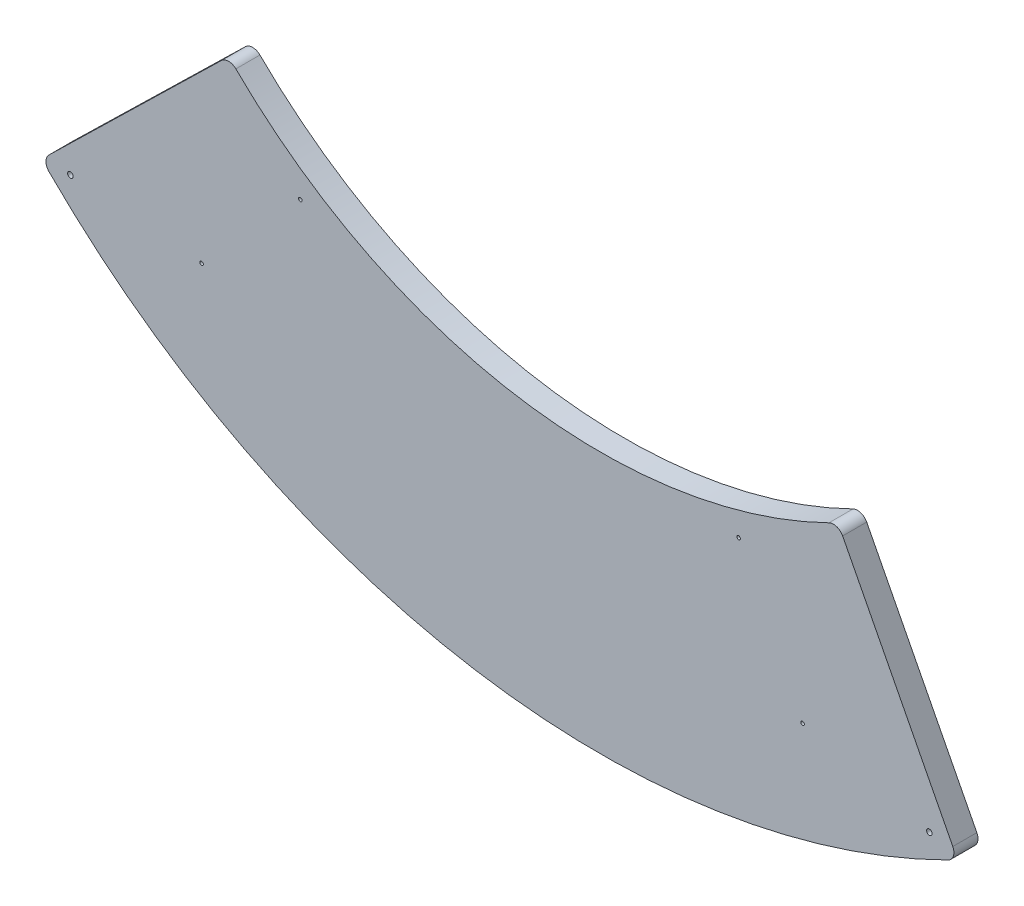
ISO-10303-21;
HEADER;
FILE_DESCRIPTION(('STEP AP214'),'2;1');
FILE_NAME('part.step','',(''),(''),'','','');
FILE_SCHEMA(('AUTOMOTIVE_DESIGN { 1 0 10303 214 1 1 1 1 }'));
ENDSEC;
DATA;
#1=APPLICATION_CONTEXT('core data for automotive mechanical design processes');
#2=APPLICATION_PROTOCOL_DEFINITION('international standard','automotive_design',2000,#1);
#3=PRODUCT_CONTEXT('',#1,'mechanical');
#4=PRODUCT('Part','Part','',(#3));
#5=PRODUCT_RELATED_PRODUCT_CATEGORY('part','',(#4));
#6=PRODUCT_DEFINITION_FORMATION('','',#4);
#7=PRODUCT_DEFINITION_CONTEXT('part definition',#1,'design');
#8=PRODUCT_DEFINITION('design','',#6,#7);
#9=PRODUCT_DEFINITION_SHAPE('','',#8);
#10=(LENGTH_UNIT() NAMED_UNIT(*) SI_UNIT(.MILLI.,.METRE.));
#11=(NAMED_UNIT(*) PLANE_ANGLE_UNIT() SI_UNIT($,.RADIAN.));
#12=(NAMED_UNIT(*) SI_UNIT($,.STERADIAN.) SOLID_ANGLE_UNIT());
#13=UNCERTAINTY_MEASURE_WITH_UNIT(LENGTH_MEASURE(1.E-05),#10,'distance_accuracy_value','');
#14=(GEOMETRIC_REPRESENTATION_CONTEXT(3) GLOBAL_UNCERTAINTY_ASSIGNED_CONTEXT((#13)) GLOBAL_UNIT_ASSIGNED_CONTEXT((#10,
#11,#12)) REPRESENTATION_CONTEXT('',''));
#15=CARTESIAN_POINT('',(0.,0.,0.));
#16=DIRECTION('',(0.,0.,1.));
#17=DIRECTION('',(1.,0.,0.));
#18=AXIS2_PLACEMENT_3D('',#15,#16,#17);
#19=CARTESIAN_POINT('',(-1.33217780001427,26.0153346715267,35.));
#20=DIRECTION('',(0.,0.,-1.));
#21=DIRECTION('',(-1.,0.,0.));
#22=AXIS2_PLACEMENT_3D('',#19,#20,#21);
#23=CYLINDRICAL_SURFACE('',#22,755.);
#24=CARTESIAN_POINT('',(-1.33217780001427,26.0153346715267,0.));
#25=DIRECTION('',(0.,0.,-1.));
#26=DIRECTION('',(1.,0.,0.));
#27=AXIS2_PLACEMENT_3D('',#24,#25,#26);
#28=CIRCLE('',#27,755.);
#29=CARTESIAN_POINT('',(331.253561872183,-651.783843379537,0.));
#30=VERTEX_POINT('',#29);
#31=CARTESIAN_POINT('',(-531.749186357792,-511.276761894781,0.));
#32=VERTEX_POINT('',#31);
#33=EDGE_CURVE('E129',#30,#32,#28,.T.);
#34=ORIENTED_EDGE('',*,*,#33,.T.);
#35=DIRECTION('',(0.,0.,-1.));
#36=VECTOR('',#35,1.);
#37=CARTESIAN_POINT('',(-531.749186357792,-511.276761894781,35.));
#38=LINE('',#37,#36);
#39=CARTESIAN_POINT('',(-531.749186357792,-511.276761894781,35.));
#40=VERTEX_POINT('',#39);
#41=EDGE_CURVE('E151',#32,#40,#38,.F.);
#42=ORIENTED_EDGE('',*,*,#41,.T.);
#43=CARTESIAN_POINT('',(-1.33217780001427,26.0153346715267,35.));
#44=DIRECTION('',(0.,0.,-1.));
#45=DIRECTION('',(1.,0.,0.));
#46=AXIS2_PLACEMENT_3D('',#43,#44,#45);
#47=CIRCLE('',#46,755.);
#48=CARTESIAN_POINT('',(331.253561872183,-651.783843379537,35.));
#49=VERTEX_POINT('',#48);
#50=EDGE_CURVE('E127',#49,#40,#47,.T.);
#51=ORIENTED_EDGE('',*,*,#50,.F.);
#52=DIRECTION('',(0.,0.,-1.));
#53=VECTOR('',#52,1.);
#54=CARTESIAN_POINT('',(331.253561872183,-651.783843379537,35.));
#55=LINE('',#54,#53);
#56=EDGE_CURVE('E148',#49,#30,#55,.T.);
#57=ORIENTED_EDGE('',*,*,#56,.T.);
#58=EDGE_LOOP('',(#34,#42,#51,#57));
#59=FACE_BOUND('',#58,.T.);
#60=ADVANCED_FACE('F32',(#59),#23,.F.);
#61=CARTESIAN_POINT('',(-542.115261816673,-500.842004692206,35.));
#62=DIRECTION('',(0.697824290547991,-0.716268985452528,0.));
#63=DIRECTION('',(0.716268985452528,0.697824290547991,0.));
#64=AXIS2_PLACEMENT_3D('',#61,#62,#63);
#65=PLANE('',#64);
#66=DIRECTION('',(-0.716268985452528,-0.697824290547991,0.));
#67=VECTOR('',#66,1.);
#68=CARTESIAN_POINT('',(-542.115261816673,-500.842004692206,0.));
#69=LINE('',#68,#67);
#70=CARTESIAN_POINT('',(-552.754636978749,-511.207404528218,0.));
#71=VERTEX_POINT('',#70);
#72=CARTESIAN_POINT('',(-803.49069567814,-755.48674068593,0.));
#73=VERTEX_POINT('',#72);
#74=EDGE_CURVE('E125',#71,#73,#69,.T.);
#75=ORIENTED_EDGE('',*,*,#74,.T.);
#76=DIRECTION('',(0.,0.,-1.));
#77=VECTOR('',#76,1.);
#78=CARTESIAN_POINT('',(-803.49069567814,-755.48674068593,35.));
#79=LINE('',#78,#77);
#80=CARTESIAN_POINT('',(-803.49069567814,-755.48674068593,35.));
#81=VERTEX_POINT('',#80);
#82=EDGE_CURVE('E103',#73,#81,#79,.F.);
#83=ORIENTED_EDGE('',*,*,#82,.T.);
#84=DIRECTION('',(-0.716268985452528,-0.697824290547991,0.));
#85=VECTOR('',#84,1.);
#86=CARTESIAN_POINT('',(-542.115261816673,-500.842004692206,35.));
#87=LINE('',#86,#85);
#88=CARTESIAN_POINT('',(-552.754636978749,-511.207404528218,35.));
#89=VERTEX_POINT('',#88);
#90=EDGE_CURVE('E165',#89,#81,#87,.T.);
#91=ORIENTED_EDGE('',*,*,#90,.F.);
#92=DIRECTION('',(0.,0.,-1.));
#93=VECTOR('',#92,1.);
#94=CARTESIAN_POINT('',(-552.754636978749,-511.207404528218,35.));
#95=LINE('',#94,#93);
#96=EDGE_CURVE('E108',#89,#71,#95,.T.);
#97=ORIENTED_EDGE('',*,*,#96,.T.);
#98=EDGE_LOOP('',(#75,#83,#91,#97));
#99=FACE_BOUND('',#98,.T.);
#100=ADVANCED_FACE('F170',(#99),#65,.F.);
#101=CARTESIAN_POINT('',(-1.59353768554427,24.4100469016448,35.));
#102=DIRECTION('',(0.,0.,-1.));
#103=DIRECTION('',(-1.,0.,0.));
#104=AXIS2_PLACEMENT_3D('',#101,#102,#103);
#105=CYLINDRICAL_SURFACE('',#104,1133.69300000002);
#106=CARTESIAN_POINT('',(-1.59353768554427,24.4100469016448,35.));
#107=DIRECTION('',(0.,0.,1.));
#108=DIRECTION('',(-1.,0.,0.));
#109=AXIS2_PLACEMENT_3D('',#106,#107,#108);
#110=CIRCLE('',#109,1133.69300000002);
#111=CARTESIAN_POINT('',(-803.635221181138,-776.832086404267,35.));
#112=VERTEX_POINT('',#111);
#113=CARTESIAN_POINT('',(504.859516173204,-989.870546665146,35.));
#114=VERTEX_POINT('',#113);
#115=EDGE_CURVE('E117',#112,#114,#110,.T.);
#116=ORIENTED_EDGE('',*,*,#115,.F.);
#117=DIRECTION('',(0.,0.,-1.));
#118=VECTOR('',#117,1.);
#119=CARTESIAN_POINT('',(-803.635221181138,-776.832086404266,35.));
#120=LINE('',#119,#118);
#121=CARTESIAN_POINT('',(-803.635221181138,-776.832086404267,0.));
#122=VERTEX_POINT('',#121);
#123=EDGE_CURVE('E102',#112,#122,#120,.T.);
#124=ORIENTED_EDGE('',*,*,#123,.T.);
#125=CARTESIAN_POINT('',(-1.59353768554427,24.4100469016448,0.));
#126=DIRECTION('',(0.,0.,1.));
#127=DIRECTION('',(-1.,0.,0.));
#128=AXIS2_PLACEMENT_3D('',#125,#126,#127);
#129=CIRCLE('',#128,1133.69300000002);
#130=CARTESIAN_POINT('',(504.859516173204,-989.870546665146,0.));
#131=VERTEX_POINT('',#130);
#132=EDGE_CURVE('E115',#122,#131,#129,.T.);
#133=ORIENTED_EDGE('',*,*,#132,.T.);
#134=DIRECTION('',(0.,0.,-1.));
#135=VECTOR('',#134,1.);
#136=CARTESIAN_POINT('',(504.859516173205,-989.870546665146,35.));
#137=LINE('',#136,#135);
#138=EDGE_CURVE('E119',#131,#114,#137,.F.);
#139=ORIENTED_EDGE('',*,*,#138,.T.);
#140=EDGE_LOOP('',(#116,#124,#133,#139));
#141=FACE_BOUND('',#140,.T.);
#142=ADVANCED_FACE('F114',(#141),#105,.T.);
#143=CARTESIAN_POINT('',(344.394329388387,-645.176278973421,35.));
#144=DIRECTION('',(-0.88899551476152,-0.457915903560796,0.));
#145=DIRECTION('',(0.457915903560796,-0.88899551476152,0.));
#146=AXIS2_PLACEMENT_3D('',#143,#144,#145);
#147=PLANE('',#146);
#148=DIRECTION('',(-0.457915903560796,0.88899551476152,0.));
#149=VECTOR('',#148,1.);
#150=CARTESIAN_POINT('',(344.394329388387,-645.176278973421,35.));
#151=LINE('',#150,#149);
#152=CARTESIAN_POINT('',(511.493520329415,-969.581765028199,35.));
#153=VERTEX_POINT('',#152);
#154=CARTESIAN_POINT('',(351.196158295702,-658.381313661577,35.));
#155=VERTEX_POINT('',#154);
#156=EDGE_CURVE('E133',#153,#155,#151,.T.);
#157=ORIENTED_EDGE('',*,*,#156,.F.);
#158=DIRECTION('',(0.,0.,-1.));
#159=VECTOR('',#158,1.);
#160=CARTESIAN_POINT('',(511.493520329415,-969.581765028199,35.));
#161=LINE('',#160,#159);
#162=CARTESIAN_POINT('',(511.493520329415,-969.581765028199,0.));
#163=VERTEX_POINT('',#162);
#164=EDGE_CURVE('E11',#153,#163,#161,.T.);
#165=ORIENTED_EDGE('',*,*,#164,.T.);
#166=DIRECTION('',(-0.457915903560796,0.88899551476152,0.));
#167=VECTOR('',#166,1.);
#168=CARTESIAN_POINT('',(344.394329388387,-645.176278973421,0.));
#169=LINE('',#168,#167);
#170=CARTESIAN_POINT('',(351.196158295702,-658.381313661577,0.));
#171=VERTEX_POINT('',#170);
#172=EDGE_CURVE('E124',#163,#171,#169,.T.);
#173=ORIENTED_EDGE('',*,*,#172,.T.);
#174=DIRECTION('',(0.,0.,-1.));
#175=VECTOR('',#174,1.);
#176=CARTESIAN_POINT('',(351.196158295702,-658.381313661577,35.));
#177=LINE('',#176,#175);
#178=EDGE_CURVE('E40',#171,#155,#177,.F.);
#179=ORIENTED_EDGE('',*,*,#178,.T.);
#180=EDGE_LOOP('',(#157,#165,#173,#179));
#181=FACE_BOUND('',#180,.T.);
#182=ADVANCED_FACE('F223',(#181),#147,.F.);
#183=CARTESIAN_POINT('',(-1.33217780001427,26.0153346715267,35.));
#184=DIRECTION('',(0.,0.,1.));
#185=DIRECTION('',(1.,0.,0.));
#186=AXIS2_PLACEMENT_3D('',#183,#184,#185);
#187=PLANE('',#186);
#188=CARTESIAN_POINT('',(477.402158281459,-968.553817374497,35.));
#189=DIRECTION('',(0.,0.,1.));
#190=DIRECTION('',(1.,0.,0.));
#191=AXIS2_PLACEMENT_3D('',#188,#189,#190);
#192=CIRCLE('',#191,3.99999999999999);
#193=CARTESIAN_POINT('',(481.402158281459,-968.553817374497,35.));
#194=VERTEX_POINT('',#193);
#195=EDGE_CURVE('E206',#194,#194,#192,.T.);
#196=ORIENTED_EDGE('',*,*,#195,.F.);
#197=EDGE_LOOP('',(#196));
#198=FACE_BOUND('',#197,.T.);
#199=CARTESIAN_POINT('',(-772.564911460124,-765.262621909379,35.));
#200=DIRECTION('',(0.,0.,1.));
#201=DIRECTION('',(1.,0.,0.));
#202=AXIS2_PLACEMENT_3D('',#199,#200,#201);
#203=CIRCLE('',#202,3.99999999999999);
#204=CARTESIAN_POINT('',(-768.564911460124,-765.262621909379,35.));
#205=VERTEX_POINT('',#204);
#206=EDGE_CURVE('E200',#205,#205,#203,.T.);
#207=ORIENTED_EDGE('',*,*,#206,.F.);
#208=EDGE_LOOP('',(#207));
#209=FACE_BOUND('',#208,.T.);
#210=CARTESIAN_POINT('',(-581.594325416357,-781.229882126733,35.));
#211=DIRECTION('',(0.,0.,-1.));
#212=DIRECTION('',(-1.,0.,0.));
#213=AXIS2_PLACEMENT_3D('',#210,#211,#212);
#214=CIRCLE('',#213,2.59999999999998);
#215=CARTESIAN_POINT('',(-584.194325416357,-781.229882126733,35.));
#216=VERTEX_POINT('',#215);
#217=EDGE_CURVE('E191',#216,#216,#214,.T.);
#218=ORIENTED_EDGE('',*,*,#217,.T.);
#219=EDGE_LOOP('',(#218));
#220=FACE_BOUND('',#219,.T.);
#221=CARTESIAN_POINT('',(-437.928955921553,-629.097500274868,35.));
#222=DIRECTION('',(0.,0.,-1.));
#223=DIRECTION('',(-1.,0.,0.));
#224=AXIS2_PLACEMENT_3D('',#221,#222,#223);
#225=CIRCLE('',#224,2.60000000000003);
#226=CARTESIAN_POINT('',(-440.528955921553,-629.097500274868,35.));
#227=VERTEX_POINT('',#226);
#228=EDGE_CURVE('E185',#227,#227,#225,.T.);
#229=ORIENTED_EDGE('',*,*,#228,.T.);
#230=EDGE_LOOP('',(#229));
#231=FACE_BOUND('',#230,.T.);
#232=CARTESIAN_POINT('',(292.8911808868,-923.60649279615,35.));
#233=DIRECTION('',(0.,0.,-1.));
#234=DIRECTION('',(-1.,0.,0.));
#235=AXIS2_PLACEMENT_3D('',#232,#233,#234);
#236=CIRCLE('',#235,2.60000000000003);
#237=CARTESIAN_POINT('',(290.2911808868,-923.60649279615,35.));
#238=VERTEX_POINT('',#237);
#239=EDGE_CURVE('E180',#238,#238,#236,.T.);
#240=ORIENTED_EDGE('',*,*,#239,.T.);
#241=EDGE_LOOP('',(#240));
#242=FACE_BOUND('',#241,.T.);
#243=CARTESIAN_POINT('',(199.79500937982,-736.210914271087,35.));
#244=DIRECTION('',(0.,0.,-1.));
#245=DIRECTION('',(-1.,0.,0.));
#246=AXIS2_PLACEMENT_3D('',#243,#244,#245);
#247=CIRCLE('',#246,2.60000000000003);
#248=CARTESIAN_POINT('',(197.19500937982,-736.210914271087,35.));
#249=VERTEX_POINT('',#248);
#250=EDGE_CURVE('E171',#249,#249,#247,.T.);
#251=ORIENTED_EDGE('',*,*,#250,.T.);
#252=EDGE_LOOP('',(#251));
#253=FACE_BOUND('',#252,.T.);
#254=ORIENTED_EDGE('',*,*,#90,.T.);
#255=CARTESIAN_POINT('',(-793.02333131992,-766.230775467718,35.));
#256=DIRECTION('',(0.,0.,1.));
#257=DIRECTION('',(1.,0.,0.));
#258=AXIS2_PLACEMENT_3D('',#255,#256,#257);
#259=CIRCLE('',#258,15.);
#260=EDGE_CURVE('E146',#81,#112,#259,.T.);
#261=ORIENTED_EDGE('',*,*,#260,.T.);
#262=ORIENTED_EDGE('',*,*,#115,.T.);
#263=CARTESIAN_POINT('',(498.158587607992,-976.450503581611,35.));
#264=DIRECTION('',(0.,0.,1.));
#265=DIRECTION('',(1.,0.,0.));
#266=AXIS2_PLACEMENT_3D('',#263,#264,#265);
#267=CIRCLE('',#266,15.);
#268=EDGE_CURVE('E53',#114,#153,#267,.T.);
#269=ORIENTED_EDGE('',*,*,#268,.T.);
#270=ORIENTED_EDGE('',*,*,#156,.T.);
#271=CARTESIAN_POINT('',(337.86122557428,-665.250052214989,35.));
#272=DIRECTION('',(0.,0.,1.));
#273=DIRECTION('',(1.,0.,0.));
#274=AXIS2_PLACEMENT_3D('',#271,#272,#273);
#275=CIRCLE('',#274,15.);
#276=EDGE_CURVE('E141',#155,#49,#275,.T.);
#277=ORIENTED_EDGE('',*,*,#276,.T.);
#278=ORIENTED_EDGE('',*,*,#50,.T.);
#279=CARTESIAN_POINT('',(-542.287272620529,-521.951439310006,35.));
#280=DIRECTION('',(0.,0.,1.));
#281=DIRECTION('',(1.,0.,0.));
#282=AXIS2_PLACEMENT_3D('',#279,#280,#281);
#283=CIRCLE('',#282,15.);
#284=EDGE_CURVE('E144',#40,#89,#283,.T.);
#285=ORIENTED_EDGE('',*,*,#284,.T.);
#286=EDGE_LOOP('',(#254,#261,#262,#269,#270,#277,#278,#285));
#287=FACE_BOUND('',#286,.T.);
#288=ADVANCED_FACE('F162',(#198,#209,#220,#231,#242,#253,#287),#187,.T.);
#289=CARTESIAN_POINT('',(-1.33217780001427,26.0153346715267,0.));
#290=DIRECTION('',(0.,0.,1.));
#291=DIRECTION('',(1.,0.,0.));
#292=AXIS2_PLACEMENT_3D('',#289,#290,#291);
#293=PLANE('',#292);
#294=CARTESIAN_POINT('',(477.402158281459,-968.553817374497,0.));
#295=DIRECTION('',(0.,0.,1.));
#296=DIRECTION('',(1.,0.,0.));
#297=AXIS2_PLACEMENT_3D('',#294,#295,#296);
#298=CIRCLE('',#297,3.99999999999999);
#299=CARTESIAN_POINT('',(481.402158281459,-968.553817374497,0.));
#300=VERTEX_POINT('',#299);
#301=EDGE_CURVE('E203',#300,#300,#298,.T.);
#302=ORIENTED_EDGE('',*,*,#301,.T.);
#303=EDGE_LOOP('',(#302));
#304=FACE_BOUND('',#303,.T.);
#305=CARTESIAN_POINT('',(-772.564911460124,-765.262621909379,0.));
#306=DIRECTION('',(0.,0.,1.));
#307=DIRECTION('',(1.,0.,0.));
#308=AXIS2_PLACEMENT_3D('',#305,#306,#307);
#309=CIRCLE('',#308,3.99999999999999);
#310=CARTESIAN_POINT('',(-768.564911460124,-765.262621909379,0.));
#311=VERTEX_POINT('',#310);
#312=EDGE_CURVE('E197',#311,#311,#309,.T.);
#313=ORIENTED_EDGE('',*,*,#312,.T.);
#314=EDGE_LOOP('',(#313));
#315=FACE_BOUND('',#314,.T.);
#316=CARTESIAN_POINT('',(-581.594325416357,-781.229882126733,0.));
#317=DIRECTION('',(0.,0.,-1.));
#318=DIRECTION('',(-1.,0.,0.));
#319=AXIS2_PLACEMENT_3D('',#316,#317,#318);
#320=CIRCLE('',#319,2.59999999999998);
#321=CARTESIAN_POINT('',(-584.194325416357,-781.229882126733,0.));
#322=VERTEX_POINT('',#321);
#323=EDGE_CURVE('E194',#322,#322,#320,.T.);
#324=ORIENTED_EDGE('',*,*,#323,.F.);
#325=EDGE_LOOP('',(#324));
#326=FACE_BOUND('',#325,.T.);
#327=CARTESIAN_POINT('',(-437.928955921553,-629.097500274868,0.));
#328=DIRECTION('',(0.,0.,-1.));
#329=DIRECTION('',(-1.,0.,0.));
#330=AXIS2_PLACEMENT_3D('',#327,#328,#329);
#331=CIRCLE('',#330,2.60000000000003);
#332=CARTESIAN_POINT('',(-440.528955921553,-629.097500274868,0.));
#333=VERTEX_POINT('',#332);
#334=EDGE_CURVE('E188',#333,#333,#331,.T.);
#335=ORIENTED_EDGE('',*,*,#334,.F.);
#336=EDGE_LOOP('',(#335));
#337=FACE_BOUND('',#336,.T.);
#338=CARTESIAN_POINT('',(292.8911808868,-923.60649279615,0.));
#339=DIRECTION('',(0.,0.,-1.));
#340=DIRECTION('',(-1.,0.,0.));
#341=AXIS2_PLACEMENT_3D('',#338,#339,#340);
#342=CIRCLE('',#341,2.60000000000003);
#343=CARTESIAN_POINT('',(290.2911808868,-923.60649279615,0.));
#344=VERTEX_POINT('',#343);
#345=EDGE_CURVE('E182',#344,#344,#342,.T.);
#346=ORIENTED_EDGE('',*,*,#345,.F.);
#347=EDGE_LOOP('',(#346));
#348=FACE_BOUND('',#347,.T.);
#349=CARTESIAN_POINT('',(199.79500937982,-736.210914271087,0.));
#350=DIRECTION('',(0.,0.,-1.));
#351=DIRECTION('',(-1.,0.,0.));
#352=AXIS2_PLACEMENT_3D('',#349,#350,#351);
#353=CIRCLE('',#352,2.60000000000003);
#354=CARTESIAN_POINT('',(197.19500937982,-736.210914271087,0.));
#355=VERTEX_POINT('',#354);
#356=EDGE_CURVE('E173',#355,#355,#353,.T.);
#357=ORIENTED_EDGE('',*,*,#356,.F.);
#358=EDGE_LOOP('',(#357));
#359=FACE_BOUND('',#358,.T.);
#360=ORIENTED_EDGE('',*,*,#132,.F.);
#361=CARTESIAN_POINT('',(-793.02333131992,-766.230775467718,0.));
#362=DIRECTION('',(0.,0.,1.));
#363=DIRECTION('',(1.,0.,0.));
#364=AXIS2_PLACEMENT_3D('',#361,#362,#363);
#365=CIRCLE('',#364,15.);
#366=EDGE_CURVE('E98',#122,#73,#365,.F.);
#367=ORIENTED_EDGE('',*,*,#366,.T.);
#368=ORIENTED_EDGE('',*,*,#74,.F.);
#369=CARTESIAN_POINT('',(-542.287272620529,-521.951439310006,0.));
#370=DIRECTION('',(0.,0.,1.));
#371=DIRECTION('',(1.,0.,0.));
#372=AXIS2_PLACEMENT_3D('',#369,#370,#371);
#373=CIRCLE('',#372,15.);
#374=EDGE_CURVE('E109',#71,#32,#373,.F.);
#375=ORIENTED_EDGE('',*,*,#374,.T.);
#376=ORIENTED_EDGE('',*,*,#33,.F.);
#377=CARTESIAN_POINT('',(337.86122557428,-665.250052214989,0.));
#378=DIRECTION('',(0.,0.,1.));
#379=DIRECTION('',(1.,0.,0.));
#380=AXIS2_PLACEMENT_3D('',#377,#378,#379);
#381=CIRCLE('',#380,15.);
#382=EDGE_CURVE('E118',#30,#171,#381,.F.);
#383=ORIENTED_EDGE('',*,*,#382,.T.);
#384=ORIENTED_EDGE('',*,*,#172,.F.);
#385=CARTESIAN_POINT('',(498.158587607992,-976.450503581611,0.));
#386=DIRECTION('',(0.,0.,1.));
#387=DIRECTION('',(1.,0.,0.));
#388=AXIS2_PLACEMENT_3D('',#385,#386,#387);
#389=CIRCLE('',#388,15.);
#390=EDGE_CURVE('E123',#163,#131,#389,.F.);
#391=ORIENTED_EDGE('',*,*,#390,.T.);
#392=EDGE_LOOP('',(#360,#367,#368,#375,#376,#383,#384,#391));
#393=FACE_BOUND('',#392,.T.);
#394=ADVANCED_FACE('F121',(#304,#315,#326,#337,#348,#359,#393),#293,.F.);
#395=CARTESIAN_POINT('',(199.79500937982,-736.210914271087,35.));
#396=DIRECTION('',(0.,0.,-1.));
#397=DIRECTION('',(-1.,0.,0.));
#398=AXIS2_PLACEMENT_3D('',#395,#396,#397);
#399=CYLINDRICAL_SURFACE('',#398,2.60000000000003);
#400=ORIENTED_EDGE('',*,*,#250,.F.);
#401=EDGE_LOOP('',(#400));
#402=FACE_BOUND('',#401,.T.);
#403=ORIENTED_EDGE('',*,*,#356,.T.);
#404=EDGE_LOOP('',(#403));
#405=FACE_BOUND('',#404,.T.);
#406=ADVANCED_FACE('F235',(#402,#405),#399,.F.);
#407=CARTESIAN_POINT('',(292.8911808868,-923.60649279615,35.));
#408=DIRECTION('',(0.,0.,-1.));
#409=DIRECTION('',(-1.,0.,0.));
#410=AXIS2_PLACEMENT_3D('',#407,#408,#409);
#411=CYLINDRICAL_SURFACE('',#410,2.60000000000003);
#412=ORIENTED_EDGE('',*,*,#239,.F.);
#413=EDGE_LOOP('',(#412));
#414=FACE_BOUND('',#413,.T.);
#415=ORIENTED_EDGE('',*,*,#345,.T.);
#416=EDGE_LOOP('',(#415));
#417=FACE_BOUND('',#416,.T.);
#418=ADVANCED_FACE('F238',(#414,#417),#411,.F.);
#419=CARTESIAN_POINT('',(-437.928955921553,-629.097500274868,35.));
#420=DIRECTION('',(0.,0.,-1.));
#421=DIRECTION('',(-1.,0.,0.));
#422=AXIS2_PLACEMENT_3D('',#419,#420,#421);
#423=CYLINDRICAL_SURFACE('',#422,2.60000000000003);
#424=ORIENTED_EDGE('',*,*,#228,.F.);
#425=EDGE_LOOP('',(#424));
#426=FACE_BOUND('',#425,.T.);
#427=ORIENTED_EDGE('',*,*,#334,.T.);
#428=EDGE_LOOP('',(#427));
#429=FACE_BOUND('',#428,.T.);
#430=ADVANCED_FACE('F331',(#426,#429),#423,.F.);
#431=CARTESIAN_POINT('',(-581.594325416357,-781.229882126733,35.));
#432=DIRECTION('',(0.,0.,-1.));
#433=DIRECTION('',(-1.,0.,0.));
#434=AXIS2_PLACEMENT_3D('',#431,#432,#433);
#435=CYLINDRICAL_SURFACE('',#434,2.59999999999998);
#436=ORIENTED_EDGE('',*,*,#217,.F.);
#437=EDGE_LOOP('',(#436));
#438=FACE_BOUND('',#437,.T.);
#439=ORIENTED_EDGE('',*,*,#323,.T.);
#440=EDGE_LOOP('',(#439));
#441=FACE_BOUND('',#440,.T.);
#442=ADVANCED_FACE('F257',(#438,#441),#435,.F.);
#443=CARTESIAN_POINT('',(-793.02333131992,-766.230775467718,35.));
#444=DIRECTION('',(0.,0.,-1.));
#445=DIRECTION('',(-1.,0.,0.));
#446=AXIS2_PLACEMENT_3D('',#443,#444,#445);
#447=CYLINDRICAL_SURFACE('',#446,15.);
#448=ORIENTED_EDGE('',*,*,#260,.F.);
#449=ORIENTED_EDGE('',*,*,#82,.F.);
#450=ORIENTED_EDGE('',*,*,#366,.F.);
#451=ORIENTED_EDGE('',*,*,#123,.F.);
#452=EDGE_LOOP('',(#448,#449,#450,#451));
#453=FACE_BOUND('',#452,.T.);
#454=ADVANCED_FACE('F101',(#453),#447,.T.);
#455=CARTESIAN_POINT('',(-542.287272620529,-521.951439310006,35.));
#456=DIRECTION('',(0.,0.,-1.));
#457=DIRECTION('',(-1.,0.,0.));
#458=AXIS2_PLACEMENT_3D('',#455,#456,#457);
#459=CYLINDRICAL_SURFACE('',#458,15.);
#460=ORIENTED_EDGE('',*,*,#284,.F.);
#461=ORIENTED_EDGE('',*,*,#41,.F.);
#462=ORIENTED_EDGE('',*,*,#374,.F.);
#463=ORIENTED_EDGE('',*,*,#96,.F.);
#464=EDGE_LOOP('',(#460,#461,#462,#463));
#465=FACE_BOUND('',#464,.T.);
#466=ADVANCED_FACE('F168',(#465),#459,.T.);
#467=CARTESIAN_POINT('',(498.158587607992,-976.450503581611,35.));
#468=DIRECTION('',(0.,0.,-1.));
#469=DIRECTION('',(-1.,0.,0.));
#470=AXIS2_PLACEMENT_3D('',#467,#468,#469);
#471=CYLINDRICAL_SURFACE('',#470,15.);
#472=ORIENTED_EDGE('',*,*,#268,.F.);
#473=ORIENTED_EDGE('',*,*,#138,.F.);
#474=ORIENTED_EDGE('',*,*,#390,.F.);
#475=ORIENTED_EDGE('',*,*,#164,.F.);
#476=EDGE_LOOP('',(#472,#473,#474,#475));
#477=FACE_BOUND('',#476,.T.);
#478=ADVANCED_FACE('F259',(#477),#471,.T.);
#479=CARTESIAN_POINT('',(337.86122557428,-665.250052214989,35.));
#480=DIRECTION('',(0.,0.,-1.));
#481=DIRECTION('',(-1.,0.,0.));
#482=AXIS2_PLACEMENT_3D('',#479,#480,#481);
#483=CYLINDRICAL_SURFACE('',#482,15.);
#484=ORIENTED_EDGE('',*,*,#276,.F.);
#485=ORIENTED_EDGE('',*,*,#178,.F.);
#486=ORIENTED_EDGE('',*,*,#382,.F.);
#487=ORIENTED_EDGE('',*,*,#56,.F.);
#488=EDGE_LOOP('',(#484,#485,#486,#487));
#489=FACE_BOUND('',#488,.T.);
#490=ADVANCED_FACE('F34',(#489),#483,.T.);
#491=CARTESIAN_POINT('',(-772.564911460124,-765.262621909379,0.));
#492=DIRECTION('',(0.,0.,1.));
#493=DIRECTION('',(1.,0.,0.));
#494=AXIS2_PLACEMENT_3D('',#491,#492,#493);
#495=CYLINDRICAL_SURFACE('',#494,3.99999999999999);
#496=ORIENTED_EDGE('',*,*,#312,.F.);
#497=EDGE_LOOP('',(#496));
#498=FACE_BOUND('',#497,.T.);
#499=ORIENTED_EDGE('',*,*,#206,.T.);
#500=EDGE_LOOP('',(#499));
#501=FACE_BOUND('',#500,.T.);
#502=ADVANCED_FACE('F217',(#498,#501),#495,.F.);
#503=CARTESIAN_POINT('',(477.402158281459,-968.553817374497,0.));
#504=DIRECTION('',(0.,0.,1.));
#505=DIRECTION('',(1.,0.,0.));
#506=AXIS2_PLACEMENT_3D('',#503,#504,#505);
#507=CYLINDRICAL_SURFACE('',#506,3.99999999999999);
#508=ORIENTED_EDGE('',*,*,#301,.F.);
#509=EDGE_LOOP('',(#508));
#510=FACE_BOUND('',#509,.T.);
#511=ORIENTED_EDGE('',*,*,#195,.T.);
#512=EDGE_LOOP('',(#511));
#513=FACE_BOUND('',#512,.T.);
#514=ADVANCED_FACE('F214',(#510,#513),#507,.F.);
#515=CLOSED_SHELL('',(#60,#100,#142,#182,#288,#394,#406,#418,#430,#442,#454,#466,#478,#490,#502,#514));
#516=MANIFOLD_SOLID_BREP('B2',#515);
#517=ADVANCED_BREP_SHAPE_REPRESENTATION('',(#18,#516),#14);
#518=SHAPE_DEFINITION_REPRESENTATION(#9,#517);
ENDSEC;
END-ISO-10303-21;
